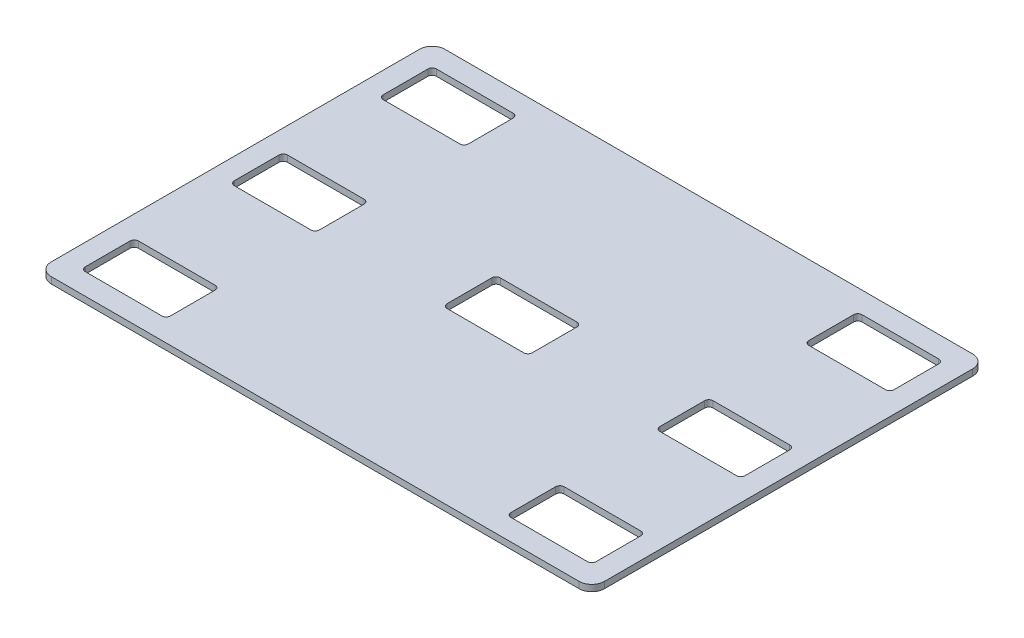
from build123d import *

# Parameters (mm, degrees)
SKETCH1_W              = 260
SKETCH1_H              = 185
EXTRUDE1_DEPTH         = 3
FILLET3_R              = 6
SKETCH2_W              = 40
SKETCH2_H              = 25
CUT_EXTRUDE1_DEPTH     = 320.11439955
FILLET1_R              = 2
LPATTERN1_COUNT        = 3
LPATTERN1_PITCH        = 70
LPATTERN1_COUNT_DIR2   = 3
LPATTERN1_PITCH_DIR2   = 100
FILLET1_OF_LPATTERN1_R = 2


with BuildPart() as part:
    # Sketch1 → Extrude1 (new body)
    with BuildSketch(Plane(origin=(0, 0, 0), x_dir=(1, 0, 0), z_dir=(0, 1, 0))):
        with Locations((130, 92.5)):
            Rectangle(SKETCH1_W, SKETCH1_H)
    extrude(amount=EXTRUDE1_DEPTH)

    # Fillet3
    fillet3_edges = [part.edges().sort_by_distance(p)[0] for p in [
        (0, 1.5, -185),
        (260, 1.5, -185),
        (260, 1.5, 0),
        (0, 1.5, 0),
    ]]
    fillet(fillet3_edges, radius=FILLET3_R)

    # Sketch2 → Cut-Extrude1 (cut, through all)
    with BuildSketch(Plane(origin=(0, 3, 0), x_dir=(-1, 0, 0), z_dir=(0, 1, 0))):
        with Locations((-30, -22.5)):
            Rectangle(SKETCH2_W, SKETCH2_H)
    cut_extrude1 = extrude(amount=-CUT_EXTRUDE1_DEPTH, mode=Mode.SUBTRACT)

    # Fillet1
    fillet1_edges = [part.edges().sort_by_distance(p)[0] for p in [
        (10, 1.5, -10),
        (10, 1.5, -35),
        (50, 1.5, -35),
        (50, 1.5, -10),
    ]]
    fillet(fillet1_edges, radius=FILLET1_R)

    # LPattern1: Cut-Extrude1 3 × 3, 2 skipped
    with Locations(*[(j * LPATTERN1_PITCH_DIR2, 0, -i * LPATTERN1_PITCH) for i in range(LPATTERN1_COUNT) for j in range(LPATTERN1_COUNT_DIR2) if (i, j) not in ((0, 0), (0, 1), (2, 1))]):
        add(cut_extrude1, mode=Mode.SUBTRACT)

    # Fillet1 of LPattern1
    fillet1_of_lpattern1_edges = [part.edges().sort_by_distance(p)[0] for p in [
        (210, 1.5, -10),
        (210, 1.5, -35),
        (250, 1.5, -35),
        (250, 1.5, -10),
        (10, 1.5, -80),
        (10, 1.5, -105),
        (50, 1.5, -105),
        (50, 1.5, -80),
        (110, 1.5, -80),
        (110, 1.5, -105),
        (150, 1.5, -105),
        (150, 1.5, -80),
        (210, 1.5, -80),
        (210, 1.5, -105),
        (250, 1.5, -105),
        (250, 1.5, -80),
        (10, 1.5, -150),
        (10, 1.5, -175),
        (50, 1.5, -175),
        (50, 1.5, -150),
        (210, 1.5, -150),
        (210, 1.5, -175),
        (250, 1.5, -175),
        (250, 1.5, -150),
    ]]
    fillet(fillet1_of_lpattern1_edges, radius=FILLET1_OF_LPATTERN1_R)


solid = part.part
